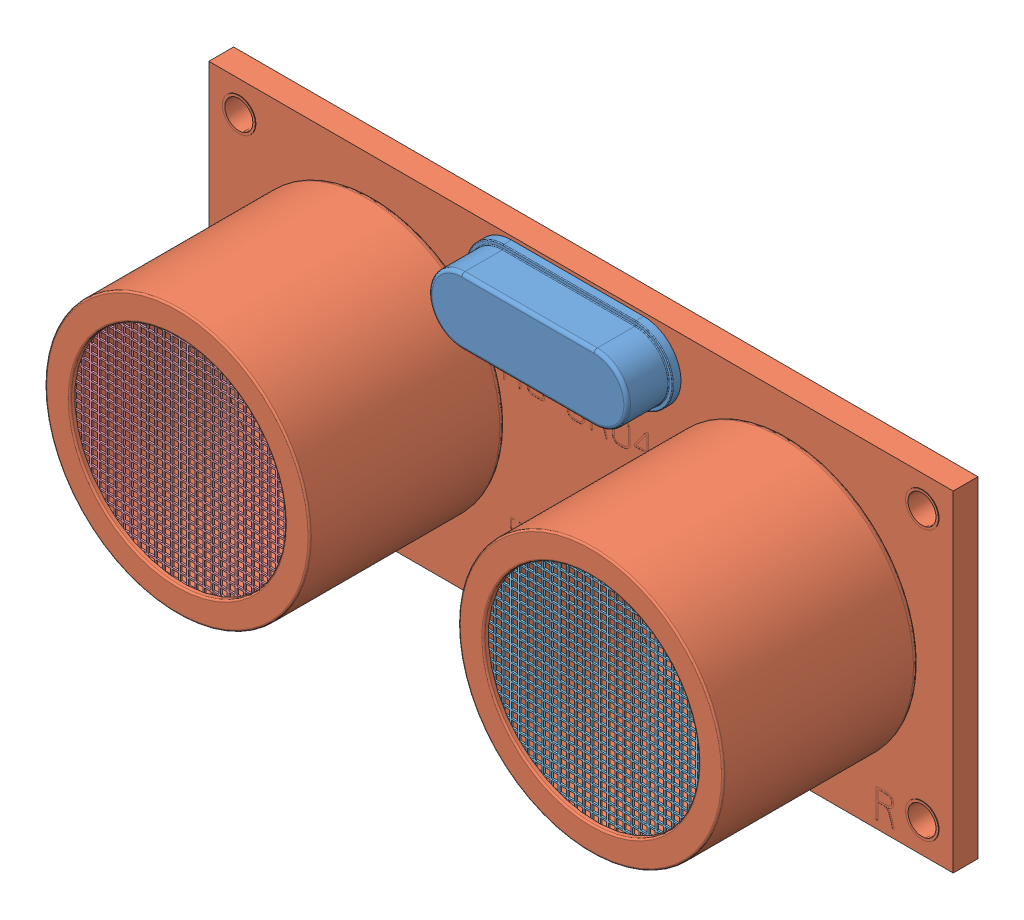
SolidWorks assembly User Library-hc-sr04-2.SLDASM, configuration Default (file format 15000). Lengths in mm.
Overall size (45 25.83 17.8).
6 component instances, 5 part files, 0 mates.
Components (placement in the parent):
- User Library-hc-sr04-2_hc-sr04.step-1: User Library-hc-sr04-2_hc-sr04.step.SLDASM [Default] at origin size (45 25.83 17.8)
  - User Library-hc-sr04-2_Quarz.step-1: User Library-hc-sr04-2_Quarz.step.SLDPRT [Default] at origin size (12.5 4.5 5.2)
  - User Library-hc-sr04-2_Platine.step-1: User Library-hc-sr04-2_Platine.step.SLDPRT [Default] at origin size (45 20 14.3)
  - User Library-hc-sr04-2_Pins_4fach_90Grad_001.step-1: User Library-hc-sr04-2_Pins_4fach_90Grad_001.step.SLDPRT [Default] at (3.81 -8.65 2.9) x (0 -1 0) z (0 0 -1) size (8.45 10.16 7.3)
  - User Library-hc-sr04-2_HC_SR04_gitter_001.step-1: User Library-hc-sr04-2_HC_SR04_gitter_001.step.SLDPRT [Default] at origin size (14.85 14.85 0.1)
  - User Library-hc-sr04-2_HC_SR04_gitter_002.step-1: User Library-hc-sr04-2_HC_SR04_gitter_002.step.SLDPRT [Default] x (-1 0 0) z (0 0 1) size (14.85 14.85 0.1)
